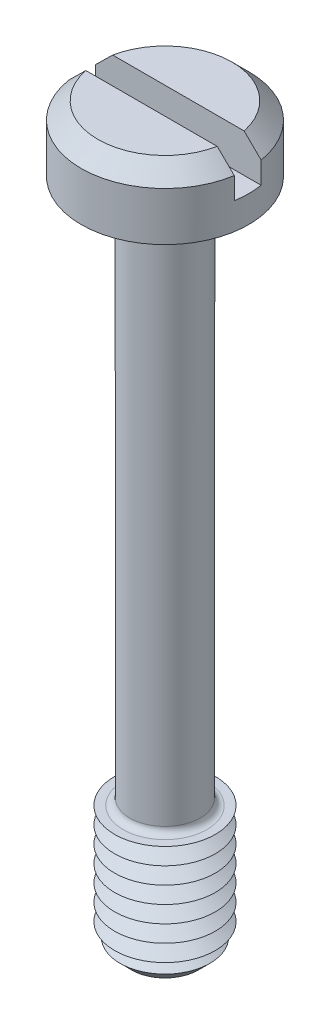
from build123d import *

# Parameters (mm, degrees)
SKETCH1_R           = 5
BOSS_EXTRUDE1_DEPTH = 3.9
SKETCH2_R           = 2.1
BOSS_EXTRUDE2_DEPTH = 40
SKETCH3_R           = 3
BOSS_EXTRUDE3_DEPTH = 7.5
CHAMFER1_SIZE       = 1
LPATTERN1_COUNT     = 7
LPATTERN1_PITCH     = 1
FILLET1_R           = 0.4
CHAMFER2_SIZE       = 1
SKETCH6_W           = 10
SKETCH6_H           = 1.6
CUT_EXTRUDE1_DEPTH  = 2.3


with BuildPart() as part:
    # Sketch1 → Boss-Extrude1 (new body)
    with BuildSketch(Plane(origin=(0, 0, 0), x_dir=(1, 0, 0), z_dir=(0, 1, 0))):
        with Locations(Location((0, 0, 0), (0, 0, 270))):
            Circle(SKETCH1_R)
    extrude(amount=BOSS_EXTRUDE1_DEPTH)

    # Sketch2 → Boss-Extrude2 (add)
    with BuildSketch(Plane.XZ):
        with Locations(Location((0, 0, 0), (0, 0, 270))):
            Circle(SKETCH2_R)
    extrude(amount=BOSS_EXTRUDE2_DEPTH)

    # Sketch3 → Boss-Extrude3 (add)
    with BuildSketch(Plane.XZ.offset(40)):
        with Locations(Location((0, 0, 0), (0, 0, 270))):
            Circle(SKETCH3_R)
    extrude(amount=-BOSS_EXTRUDE3_DEPTH)

    # Chamfer1
    chamfer1_edges = [part.edges().sort_by_distance(p)[0] for p in [
        (0, -40, 3),
    ]]
    chamfer(chamfer1_edges, length=CHAMFER1_SIZE)

    # Sketch5 → Cut-Revolve1 (revolve, cut)
    with BuildSketch(Plane(origin=(0, 0, 0), x_dir=(0, 0, -1), z_dir=(1, 0, 0))):
        Polygon((-3, -32.5), (-2.133974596, -33), (-3, -33.5), align=None)
    cut_revolve1 = revolve(axis=Axis((0, -6.58711856, 0), (0, -1, 0)), mode=Mode.SUBTRACT)

    # LPattern1: Cut-Revolve1 ×7
    with Locations(*[(0, -i * LPATTERN1_PITCH, 0) for i in range(1, LPATTERN1_COUNT)]):
        add(cut_revolve1, mode=Mode.SUBTRACT)

    # Fillet1
    fillet1_edges = [part.edges().sort_by_distance(p)[0] for p in [
        (0, 0, 2.1),
        (0, -32.5, 2.1),
    ]]
    fillet(fillet1_edges, radius=FILLET1_R)

    # Chamfer2
    chamfer2_edges = [part.edges().sort_by_distance(p)[0] for p in [
        (0, 3.9, -5),
    ]]
    chamfer(chamfer2_edges, length=CHAMFER2_SIZE)

    # Sketch6 → Cut-Extrude1 (cut)
    with BuildSketch(Plane(origin=(0, 3.9, 0), x_dir=(1, 0, 0), z_dir=(0, 1, 0))):
        Rectangle(SKETCH6_W, SKETCH6_H)
    extrude(amount=-CUT_EXTRUDE1_DEPTH, mode=Mode.SUBTRACT)


solid = part.part
